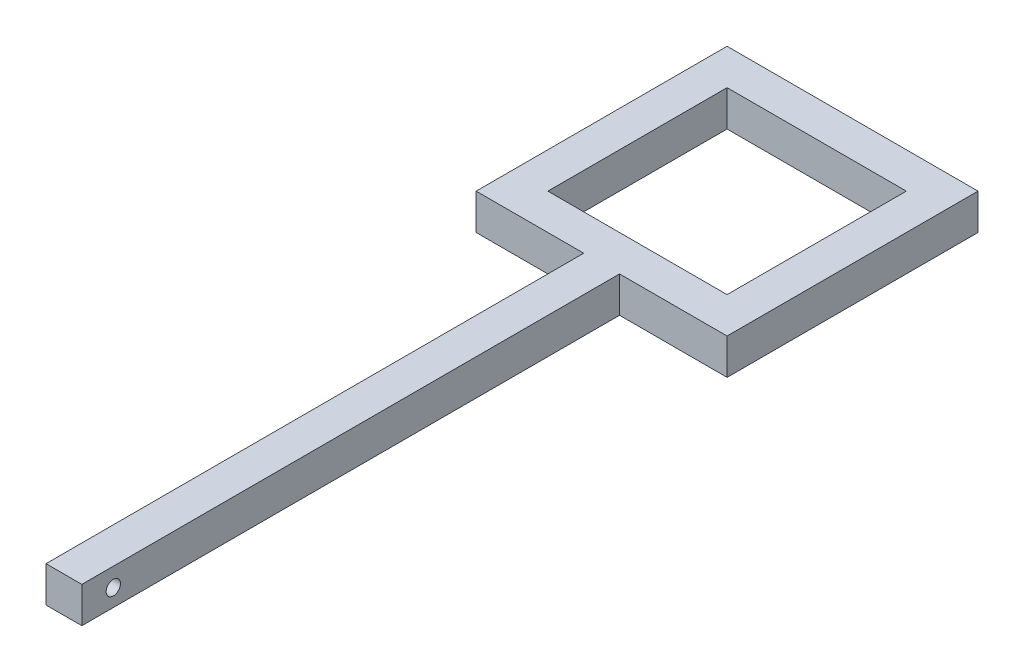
ISO-10303-21;
HEADER;
FILE_DESCRIPTION(('STEP AP214'),'2;1');
FILE_NAME('part.step','',(''),(''),'','','');
FILE_SCHEMA(('AUTOMOTIVE_DESIGN { 1 0 10303 214 1 1 1 1 }'));
ENDSEC;
DATA;
#1=APPLICATION_CONTEXT('core data for automotive mechanical design processes');
#2=APPLICATION_PROTOCOL_DEFINITION('international standard','automotive_design',2000,#1);
#3=PRODUCT_CONTEXT('',#1,'mechanical');
#4=PRODUCT('Part','Part','',(#3));
#5=PRODUCT_RELATED_PRODUCT_CATEGORY('part','',(#4));
#6=PRODUCT_DEFINITION_FORMATION('','',#4);
#7=PRODUCT_DEFINITION_CONTEXT('part definition',#1,'design');
#8=PRODUCT_DEFINITION('design','',#6,#7);
#9=PRODUCT_DEFINITION_SHAPE('','',#8);
#10=(LENGTH_UNIT() NAMED_UNIT(*) SI_UNIT(.MILLI.,.METRE.));
#11=(NAMED_UNIT(*) PLANE_ANGLE_UNIT() SI_UNIT($,.RADIAN.));
#12=(NAMED_UNIT(*) SI_UNIT($,.STERADIAN.) SOLID_ANGLE_UNIT());
#13=UNCERTAINTY_MEASURE_WITH_UNIT(LENGTH_MEASURE(1.E-05),#10,'distance_accuracy_value','');
#14=(GEOMETRIC_REPRESENTATION_CONTEXT(3) GLOBAL_UNCERTAINTY_ASSIGNED_CONTEXT((#13)) GLOBAL_UNIT_ASSIGNED_CONTEXT((#10,
#11,#12)) REPRESENTATION_CONTEXT('',''));
#15=CARTESIAN_POINT('',(0.,0.,0.));
#16=DIRECTION('',(0.,0.,1.));
#17=DIRECTION('',(1.,0.,0.));
#18=AXIS2_PLACEMENT_3D('',#15,#16,#17);
#19=CARTESIAN_POINT('',(0.,0.,-320.));
#20=DIRECTION('',(0.,0.,1.));
#21=DIRECTION('',(1.,0.,0.));
#22=AXIS2_PLACEMENT_3D('',#19,#20,#21);
#23=PLANE('',#22);
#24=DIRECTION('',(0.,-1.,0.));
#25=VECTOR('',#24,1.);
#26=CARTESIAN_POINT('',(-40.,0.,-320.));
#27=LINE('',#26,#25);
#28=CARTESIAN_POINT('',(-40.,20.,-320.));
#29=VERTEX_POINT('',#28);
#30=CARTESIAN_POINT('',(-40.,0.,-320.));
#31=VERTEX_POINT('',#30);
#32=EDGE_CURVE('E57',#29,#31,#27,.T.);
#33=ORIENTED_EDGE('',*,*,#32,.F.);
#34=DIRECTION('',(1.,0.,0.));
#35=VECTOR('',#34,1.);
#36=CARTESIAN_POINT('',(80.,20.,-320.));
#37=LINE('',#36,#35);
#38=CARTESIAN_POINT('',(60.,20.,-320.));
#39=VERTEX_POINT('',#38);
#40=EDGE_CURVE('E209',#29,#39,#37,.T.);
#41=ORIENTED_EDGE('',*,*,#40,.T.);
#42=DIRECTION('',(0.,1.,0.));
#43=VECTOR('',#42,1.);
#44=CARTESIAN_POINT('',(60.,0.,-320.));
#45=LINE('',#44,#43);
#46=CARTESIAN_POINT('',(60.,0.,-320.));
#47=VERTEX_POINT('',#46);
#48=EDGE_CURVE('E192',#47,#39,#45,.T.);
#49=ORIENTED_EDGE('',*,*,#48,.F.);
#50=DIRECTION('',(-1.,0.,0.));
#51=VECTOR('',#50,1.);
#52=CARTESIAN_POINT('',(80.,0.,-320.));
#53=LINE('',#52,#51);
#54=EDGE_CURVE('E62',#47,#31,#53,.T.);
#55=ORIENTED_EDGE('',*,*,#54,.T.);
#56=EDGE_LOOP('',(#33,#41,#49,#55));
#57=FACE_BOUND('',#56,.T.);
#58=ADVANCED_FACE('F41',(#57),#23,.F.);
#59=CARTESIAN_POINT('',(0.,20.,0.));
#60=DIRECTION('',(1.,0.,0.));
#61=DIRECTION('',(0.,0.,-1.));
#62=AXIS2_PLACEMENT_3D('',#59,#60,#61);
#63=PLANE('',#62);
#64=CARTESIAN_POINT('',(0.,9.63922554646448,-17.5535703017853));
#65=DIRECTION('',(1.,0.,0.));
#66=DIRECTION('',(0.,0.,-1.));
#67=AXIS2_PLACEMENT_3D('',#64,#65,#66);
#68=CIRCLE('',#67,4.);
#69=CARTESIAN_POINT('',(0.,9.63922554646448,-21.5535703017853));
#70=VERTEX_POINT('',#69);
#71=EDGE_CURVE('E176',#70,#70,#68,.T.);
#72=ORIENTED_EDGE('',*,*,#71,.T.);
#73=EDGE_LOOP('',(#72));
#74=FACE_BOUND('',#73,.T.);
#75=DIRECTION('',(0.,0.,1.));
#76=VECTOR('',#75,1.);
#77=CARTESIAN_POINT('',(0.,0.,0.));
#78=LINE('',#77,#76);
#79=CARTESIAN_POINT('',(0.,0.,-300.));
#80=VERTEX_POINT('',#79);
#81=CARTESIAN_POINT('',(0.,0.,0.));
#82=VERTEX_POINT('',#81);
#83=EDGE_CURVE('E236',#80,#82,#78,.T.);
#84=ORIENTED_EDGE('',*,*,#83,.T.);
#85=DIRECTION('',(0.,-1.,0.));
#86=VECTOR('',#85,1.);
#87=CARTESIAN_POINT('',(0.,20.,0.));
#88=LINE('',#87,#86);
#89=CARTESIAN_POINT('',(0.,20.,0.));
#90=VERTEX_POINT('',#89);
#91=EDGE_CURVE('E11',#90,#82,#88,.T.);
#92=ORIENTED_EDGE('',*,*,#91,.F.);
#93=DIRECTION('',(0.,0.,1.));
#94=VECTOR('',#93,1.);
#95=CARTESIAN_POINT('',(0.,20.,0.));
#96=LINE('',#95,#94);
#97=CARTESIAN_POINT('',(0.,20.,-300.));
#98=VERTEX_POINT('',#97);
#99=EDGE_CURVE('E237',#98,#90,#96,.T.);
#100=ORIENTED_EDGE('',*,*,#99,.F.);
#101=DIRECTION('',(0.,-1.,0.));
#102=VECTOR('',#101,1.);
#103=CARTESIAN_POINT('',(0.,20.,-300.));
#104=LINE('',#103,#102);
#105=EDGE_CURVE('E248',#98,#80,#104,.T.);
#106=ORIENTED_EDGE('',*,*,#105,.T.);
#107=EDGE_LOOP('',(#84,#92,#100,#106));
#108=FACE_BOUND('',#107,.T.);
#109=ADVANCED_FACE('F43',(#74,#108),#63,.F.);
#110=CARTESIAN_POINT('',(0.,20.,0.));
#111=DIRECTION('',(0.,0.,-1.));
#112=DIRECTION('',(-1.,0.,0.));
#113=AXIS2_PLACEMENT_3D('',#110,#111,#112);
#114=PLANE('',#113);
#115=DIRECTION('',(1.,0.,0.));
#116=VECTOR('',#115,1.);
#117=CARTESIAN_POINT('',(0.,0.,0.));
#118=LINE('',#117,#116);
#119=CARTESIAN_POINT('',(20.,0.,0.));
#120=VERTEX_POINT('',#119);
#121=EDGE_CURVE('E252',#82,#120,#118,.T.);
#122=ORIENTED_EDGE('',*,*,#121,.T.);
#123=DIRECTION('',(0.,-1.,0.));
#124=VECTOR('',#123,1.);
#125=CARTESIAN_POINT('',(20.,20.,0.));
#126=LINE('',#125,#124);
#127=CARTESIAN_POINT('',(20.,20.,0.));
#128=VERTEX_POINT('',#127);
#129=EDGE_CURVE('E50',#128,#120,#126,.T.);
#130=ORIENTED_EDGE('',*,*,#129,.F.);
#131=DIRECTION('',(1.,0.,0.));
#132=VECTOR('',#131,1.);
#133=CARTESIAN_POINT('',(0.,20.,0.));
#134=LINE('',#133,#132);
#135=EDGE_CURVE('E241',#90,#128,#134,.T.);
#136=ORIENTED_EDGE('',*,*,#135,.F.);
#137=ORIENTED_EDGE('',*,*,#91,.T.);
#138=EDGE_LOOP('',(#122,#130,#136,#137));
#139=FACE_BOUND('',#138,.T.);
#140=ADVANCED_FACE('F312',(#139),#114,.F.);
#141=CARTESIAN_POINT('',(20.,20.,0.));
#142=DIRECTION('',(-1.,0.,0.));
#143=DIRECTION('',(0.,0.,1.));
#144=AXIS2_PLACEMENT_3D('',#141,#142,#143);
#145=PLANE('',#144);
#146=CARTESIAN_POINT('',(20.,9.63922554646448,-17.5535703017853));
#147=DIRECTION('',(1.,0.,0.));
#148=DIRECTION('',(0.,0.,-1.));
#149=AXIS2_PLACEMENT_3D('',#146,#147,#148);
#150=CIRCLE('',#149,4.);
#151=CARTESIAN_POINT('',(20.,9.63922554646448,-21.5535703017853));
#152=VERTEX_POINT('',#151);
#153=EDGE_CURVE('E167',#152,#152,#150,.T.);
#154=ORIENTED_EDGE('',*,*,#153,.F.);
#155=EDGE_LOOP('',(#154));
#156=FACE_BOUND('',#155,.T.);
#157=DIRECTION('',(0.,0.,-1.));
#158=VECTOR('',#157,1.);
#159=CARTESIAN_POINT('',(20.,0.,0.));
#160=LINE('',#159,#158);
#161=CARTESIAN_POINT('',(19.9999999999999,0.,-300.));
#162=VERTEX_POINT('',#161);
#163=EDGE_CURVE('E242',#120,#162,#160,.T.);
#164=ORIENTED_EDGE('',*,*,#163,.T.);
#165=DIRECTION('',(0.,-1.,0.));
#166=VECTOR('',#165,1.);
#167=CARTESIAN_POINT('',(19.9999999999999,20.,-300.));
#168=LINE('',#167,#166);
#169=CARTESIAN_POINT('',(19.9999999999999,20.,-300.));
#170=VERTEX_POINT('',#169);
#171=EDGE_CURVE('E259',#170,#162,#168,.T.);
#172=ORIENTED_EDGE('',*,*,#171,.F.);
#173=DIRECTION('',(0.,0.,-1.));
#174=VECTOR('',#173,1.);
#175=CARTESIAN_POINT('',(20.,20.,0.));
#176=LINE('',#175,#174);
#177=EDGE_CURVE('E245',#128,#170,#176,.T.);
#178=ORIENTED_EDGE('',*,*,#177,.F.);
#179=ORIENTED_EDGE('',*,*,#129,.T.);
#180=EDGE_LOOP('',(#164,#172,#178,#179));
#181=FACE_BOUND('',#180,.T.);
#182=ADVANCED_FACE('F268',(#156,#181),#145,.F.);
#183=CARTESIAN_POINT('',(0.,20.,0.));
#184=DIRECTION('',(0.,-1.,0.));
#185=DIRECTION('',(0.,0.,-1.));
#186=AXIS2_PLACEMENT_3D('',#183,#184,#185);
#187=PLANE('',#186);
#188=DIRECTION('',(0.,0.,1.));
#189=VECTOR('',#188,1.);
#190=CARTESIAN_POINT('',(80.,20.,-320.));
#191=LINE('',#190,#189);
#192=CARTESIAN_POINT('',(80.,20.,-440.));
#193=VERTEX_POINT('',#192);
#194=CARTESIAN_POINT('',(80.,20.,-300.));
#195=VERTEX_POINT('',#194);
#196=EDGE_CURVE('E141',#193,#195,#191,.T.);
#197=ORIENTED_EDGE('',*,*,#196,.F.);
#198=DIRECTION('',(1.,0.,0.));
#199=VECTOR('',#198,1.);
#200=CARTESIAN_POINT('',(80.,20.,-440.));
#201=LINE('',#200,#199);
#202=CARTESIAN_POINT('',(-60.,20.,-440.));
#203=VERTEX_POINT('',#202);
#204=EDGE_CURVE('E158',#203,#193,#201,.T.);
#205=ORIENTED_EDGE('',*,*,#204,.F.);
#206=DIRECTION('',(0.,0.,1.));
#207=VECTOR('',#206,1.);
#208=CARTESIAN_POINT('',(-60.,20.,-320.));
#209=LINE('',#208,#207);
#210=CARTESIAN_POINT('',(-60.,20.,-300.));
#211=VERTEX_POINT('',#210);
#212=EDGE_CURVE('E232',#203,#211,#209,.T.);
#213=ORIENTED_EDGE('',*,*,#212,.T.);
#214=DIRECTION('',(1.,0.,0.));
#215=VECTOR('',#214,1.);
#216=CARTESIAN_POINT('',(80.,20.,-300.));
#217=LINE('',#216,#215);
#218=EDGE_CURVE('E219',#211,#98,#217,.T.);
#219=ORIENTED_EDGE('',*,*,#218,.T.);
#220=ORIENTED_EDGE('',*,*,#99,.T.);
#221=ORIENTED_EDGE('',*,*,#135,.T.);
#222=ORIENTED_EDGE('',*,*,#177,.T.);
#223=EDGE_CURVE('E218',#170,#195,#217,.T.);
#224=ORIENTED_EDGE('',*,*,#223,.T.);
#225=EDGE_LOOP('',(#197,#205,#213,#219,#220,#221,#222,#224));
#226=FACE_BOUND('',#225,.T.);
#227=DIRECTION('',(1.,0.,0.));
#228=VECTOR('',#227,1.);
#229=CARTESIAN_POINT('',(80.,20.,-420.));
#230=LINE('',#229,#228);
#231=CARTESIAN_POINT('',(-40.,20.,-420.));
#232=VERTEX_POINT('',#231);
#233=CARTESIAN_POINT('',(60.,20.,-420.));
#234=VERTEX_POINT('',#233);
#235=EDGE_CURVE('E160',#232,#234,#230,.T.);
#236=ORIENTED_EDGE('',*,*,#235,.T.);
#237=DIRECTION('',(0.,0.,1.));
#238=VECTOR('',#237,1.);
#239=CARTESIAN_POINT('',(60.,20.,-420.));
#240=LINE('',#239,#238);
#241=EDGE_CURVE('E197',#234,#39,#240,.T.);
#242=ORIENTED_EDGE('',*,*,#241,.T.);
#243=ORIENTED_EDGE('',*,*,#40,.F.);
#244=DIRECTION('',(0.,0.,1.));
#245=VECTOR('',#244,1.);
#246=CARTESIAN_POINT('',(-40.,20.,-420.));
#247=LINE('',#246,#245);
#248=EDGE_CURVE('E188',#232,#29,#247,.T.);
#249=ORIENTED_EDGE('',*,*,#248,.F.);
#250=EDGE_LOOP('',(#236,#242,#243,#249));
#251=FACE_BOUND('',#250,.T.);
#252=ADVANCED_FACE('F284',(#226,#251),#187,.F.);
#253=CARTESIAN_POINT('',(0.,0.,0.));
#254=DIRECTION('',(0.,-1.,0.));
#255=DIRECTION('',(0.,0.,-1.));
#256=AXIS2_PLACEMENT_3D('',#253,#254,#255);
#257=PLANE('',#256);
#258=DIRECTION('',(0.,0.,1.));
#259=VECTOR('',#258,1.);
#260=CARTESIAN_POINT('',(60.,0.,-420.));
#261=LINE('',#260,#259);
#262=CARTESIAN_POINT('',(60.,0.,-420.));
#263=VERTEX_POINT('',#262);
#264=EDGE_CURVE('E204',#263,#47,#261,.T.);
#265=ORIENTED_EDGE('',*,*,#264,.F.);
#266=DIRECTION('',(-1.,0.,0.));
#267=VECTOR('',#266,1.);
#268=CARTESIAN_POINT('',(80.,0.,-420.));
#269=LINE('',#268,#267);
#270=CARTESIAN_POINT('',(-40.,0.,-420.));
#271=VERTEX_POINT('',#270);
#272=EDGE_CURVE('E164',#263,#271,#269,.T.);
#273=ORIENTED_EDGE('',*,*,#272,.T.);
#274=DIRECTION('',(0.,0.,1.));
#275=VECTOR('',#274,1.);
#276=CARTESIAN_POINT('',(-40.,0.,-420.));
#277=LINE('',#276,#275);
#278=EDGE_CURVE('E182',#271,#31,#277,.T.);
#279=ORIENTED_EDGE('',*,*,#278,.T.);
#280=ORIENTED_EDGE('',*,*,#54,.F.);
#281=EDGE_LOOP('',(#265,#273,#279,#280));
#282=FACE_BOUND('',#281,.T.);
#283=ORIENTED_EDGE('',*,*,#83,.F.);
#284=DIRECTION('',(-1.,0.,0.));
#285=VECTOR('',#284,1.);
#286=CARTESIAN_POINT('',(80.,0.,-300.));
#287=LINE('',#286,#285);
#288=CARTESIAN_POINT('',(-60.,0.,-300.));
#289=VERTEX_POINT('',#288);
#290=EDGE_CURVE('E225',#80,#289,#287,.T.);
#291=ORIENTED_EDGE('',*,*,#290,.T.);
#292=DIRECTION('',(0.,0.,1.));
#293=VECTOR('',#292,1.);
#294=CARTESIAN_POINT('',(-60.,0.,-320.));
#295=LINE('',#294,#293);
#296=CARTESIAN_POINT('',(-60.,0.,-440.));
#297=VERTEX_POINT('',#296);
#298=EDGE_CURVE('E142',#297,#289,#295,.T.);
#299=ORIENTED_EDGE('',*,*,#298,.F.);
#300=DIRECTION('',(-1.,0.,0.));
#301=VECTOR('',#300,1.);
#302=CARTESIAN_POINT('',(80.,0.,-440.));
#303=LINE('',#302,#301);
#304=CARTESIAN_POINT('',(80.,0.,-440.));
#305=VERTEX_POINT('',#304);
#306=EDGE_CURVE('E145',#305,#297,#303,.T.);
#307=ORIENTED_EDGE('',*,*,#306,.F.);
#308=DIRECTION('',(0.,0.,1.));
#309=VECTOR('',#308,1.);
#310=CARTESIAN_POINT('',(80.,0.,-320.));
#311=LINE('',#310,#309);
#312=CARTESIAN_POINT('',(80.,0.,-300.));
#313=VERTEX_POINT('',#312);
#314=EDGE_CURVE('E129',#305,#313,#311,.T.);
#315=ORIENTED_EDGE('',*,*,#314,.T.);
#316=EDGE_CURVE('E212',#313,#162,#287,.T.);
#317=ORIENTED_EDGE('',*,*,#316,.T.);
#318=ORIENTED_EDGE('',*,*,#163,.F.);
#319=ORIENTED_EDGE('',*,*,#121,.F.);
#320=EDGE_LOOP('',(#283,#291,#299,#307,#315,#317,#318,#319));
#321=FACE_BOUND('',#320,.T.);
#322=ADVANCED_FACE('F147',(#282,#321),#257,.T.);
#323=CARTESIAN_POINT('',(0.,0.,-300.));
#324=DIRECTION('',(0.,0.,1.));
#325=DIRECTION('',(1.,0.,0.));
#326=AXIS2_PLACEMENT_3D('',#323,#324,#325);
#327=PLANE('',#326);
#328=ORIENTED_EDGE('',*,*,#105,.F.);
#329=ORIENTED_EDGE('',*,*,#218,.F.);
#330=DIRECTION('',(0.,1.,0.));
#331=VECTOR('',#330,1.);
#332=CARTESIAN_POINT('',(-60.,0.,-300.));
#333=LINE('',#332,#331);
#334=EDGE_CURVE('E208',#289,#211,#333,.T.);
#335=ORIENTED_EDGE('',*,*,#334,.F.);
#336=ORIENTED_EDGE('',*,*,#290,.F.);
#337=EDGE_LOOP('',(#328,#329,#335,#336));
#338=FACE_BOUND('',#337,.T.);
#339=ADVANCED_FACE('F283',(#338),#327,.T.);
#340=CARTESIAN_POINT('',(-60.,0.,-320.));
#341=DIRECTION('',(1.,0.,0.));
#342=DIRECTION('',(0.,0.,-1.));
#343=AXIS2_PLACEMENT_3D('',#340,#341,#342);
#344=PLANE('',#343);
#345=ORIENTED_EDGE('',*,*,#334,.T.);
#346=ORIENTED_EDGE('',*,*,#212,.F.);
#347=DIRECTION('',(0.,1.,0.));
#348=VECTOR('',#347,1.);
#349=CARTESIAN_POINT('',(-60.,0.,-440.));
#350=LINE('',#349,#348);
#351=EDGE_CURVE('E153',#297,#203,#350,.T.);
#352=ORIENTED_EDGE('',*,*,#351,.F.);
#353=ORIENTED_EDGE('',*,*,#298,.T.);
#354=EDGE_LOOP('',(#345,#346,#352,#353));
#355=FACE_BOUND('',#354,.T.);
#356=ADVANCED_FACE('F282',(#355),#344,.F.);
#357=CARTESIAN_POINT('',(80.,0.,-320.));
#358=DIRECTION('',(-1.,0.,0.));
#359=DIRECTION('',(0.,0.,1.));
#360=AXIS2_PLACEMENT_3D('',#357,#358,#359);
#361=PLANE('',#360);
#362=DIRECTION('',(0.,-1.,0.));
#363=VECTOR('',#362,1.);
#364=CARTESIAN_POINT('',(80.,0.,-300.));
#365=LINE('',#364,#363);
#366=EDGE_CURVE('E136',#195,#313,#365,.T.);
#367=ORIENTED_EDGE('',*,*,#366,.T.);
#368=ORIENTED_EDGE('',*,*,#314,.F.);
#369=DIRECTION('',(0.,-1.,0.));
#370=VECTOR('',#369,1.);
#371=CARTESIAN_POINT('',(80.,0.,-440.));
#372=LINE('',#371,#370);
#373=EDGE_CURVE('E134',#193,#305,#372,.T.);
#374=ORIENTED_EDGE('',*,*,#373,.F.);
#375=ORIENTED_EDGE('',*,*,#196,.T.);
#376=EDGE_LOOP('',(#367,#368,#374,#375));
#377=FACE_BOUND('',#376,.T.);
#378=ADVANCED_FACE('F131',(#377),#361,.F.);
#379=ORIENTED_EDGE('',*,*,#223,.F.);
#380=ORIENTED_EDGE('',*,*,#171,.T.);
#381=ORIENTED_EDGE('',*,*,#316,.F.);
#382=ORIENTED_EDGE('',*,*,#366,.F.);
#383=EDGE_LOOP('',(#379,#380,#381,#382));
#384=FACE_BOUND('',#383,.T.);
#385=ADVANCED_FACE('F273',(#384),#327,.T.);
#386=CARTESIAN_POINT('',(60.,0.,-420.));
#387=DIRECTION('',(1.,0.,0.));
#388=DIRECTION('',(0.,0.,-1.));
#389=AXIS2_PLACEMENT_3D('',#386,#387,#388);
#390=PLANE('',#389);
#391=ORIENTED_EDGE('',*,*,#48,.T.);
#392=ORIENTED_EDGE('',*,*,#241,.F.);
#393=DIRECTION('',(0.,1.,0.));
#394=VECTOR('',#393,1.);
#395=CARTESIAN_POINT('',(60.,0.,-420.));
#396=LINE('',#395,#394);
#397=EDGE_CURVE('E193',#263,#234,#396,.T.);
#398=ORIENTED_EDGE('',*,*,#397,.F.);
#399=ORIENTED_EDGE('',*,*,#264,.T.);
#400=EDGE_LOOP('',(#391,#392,#398,#399));
#401=FACE_BOUND('',#400,.T.);
#402=ADVANCED_FACE('F295',(#401),#390,.F.);
#403=CARTESIAN_POINT('',(-40.,0.,-420.));
#404=DIRECTION('',(-1.,0.,0.));
#405=DIRECTION('',(0.,0.,1.));
#406=AXIS2_PLACEMENT_3D('',#403,#404,#405);
#407=PLANE('',#406);
#408=ORIENTED_EDGE('',*,*,#32,.T.);
#409=ORIENTED_EDGE('',*,*,#278,.F.);
#410=DIRECTION('',(0.,-1.,0.));
#411=VECTOR('',#410,1.);
#412=CARTESIAN_POINT('',(-40.,0.,-420.));
#413=LINE('',#412,#411);
#414=EDGE_CURVE('E178',#232,#271,#413,.T.);
#415=ORIENTED_EDGE('',*,*,#414,.F.);
#416=ORIENTED_EDGE('',*,*,#248,.T.);
#417=EDGE_LOOP('',(#408,#409,#415,#416));
#418=FACE_BOUND('',#417,.T.);
#419=ADVANCED_FACE('F298',(#418),#407,.F.);
#420=CARTESIAN_POINT('',(0.,0.,-420.));
#421=DIRECTION('',(0.,0.,1.));
#422=DIRECTION('',(1.,0.,0.));
#423=AXIS2_PLACEMENT_3D('',#420,#421,#422);
#424=PLANE('',#423);
#425=ORIENTED_EDGE('',*,*,#397,.T.);
#426=ORIENTED_EDGE('',*,*,#235,.F.);
#427=ORIENTED_EDGE('',*,*,#414,.T.);
#428=ORIENTED_EDGE('',*,*,#272,.F.);
#429=EDGE_LOOP('',(#425,#426,#427,#428));
#430=FACE_BOUND('',#429,.T.);
#431=ADVANCED_FACE('F291',(#430),#424,.T.);
#432=CARTESIAN_POINT('',(0.,0.,-440.));
#433=DIRECTION('',(0.,0.,1.));
#434=DIRECTION('',(1.,0.,0.));
#435=AXIS2_PLACEMENT_3D('',#432,#433,#434);
#436=PLANE('',#435);
#437=ORIENTED_EDGE('',*,*,#373,.T.);
#438=ORIENTED_EDGE('',*,*,#306,.T.);
#439=ORIENTED_EDGE('',*,*,#351,.T.);
#440=ORIENTED_EDGE('',*,*,#204,.T.);
#441=EDGE_LOOP('',(#437,#438,#439,#440));
#442=FACE_BOUND('',#441,.T.);
#443=ADVANCED_FACE('F156',(#442),#436,.F.);
#444=CARTESIAN_POINT('',(0.,9.63922554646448,-17.5535703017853));
#445=DIRECTION('',(1.,0.,0.));
#446=DIRECTION('',(0.,0.,-1.));
#447=AXIS2_PLACEMENT_3D('',#444,#445,#446);
#448=CYLINDRICAL_SURFACE('',#447,4.);
#449=ORIENTED_EDGE('',*,*,#71,.F.);
#450=EDGE_LOOP('',(#449));
#451=FACE_BOUND('',#450,.T.);
#452=ORIENTED_EDGE('',*,*,#153,.T.);
#453=EDGE_LOOP('',(#452));
#454=FACE_BOUND('',#453,.T.);
#455=ADVANCED_FACE('F385',(#451,#454),#448,.F.);
#456=CLOSED_SHELL('',(#58,#109,#140,#182,#252,#322,#339,#356,#378,#385,#402,#419,#431,#443,#455));
#457=MANIFOLD_SOLID_BREP('B2',#456);
#458=ADVANCED_BREP_SHAPE_REPRESENTATION('',(#18,#457),#14);
#459=SHAPE_DEFINITION_REPRESENTATION(#9,#458);
ENDSEC;
END-ISO-10303-21;
